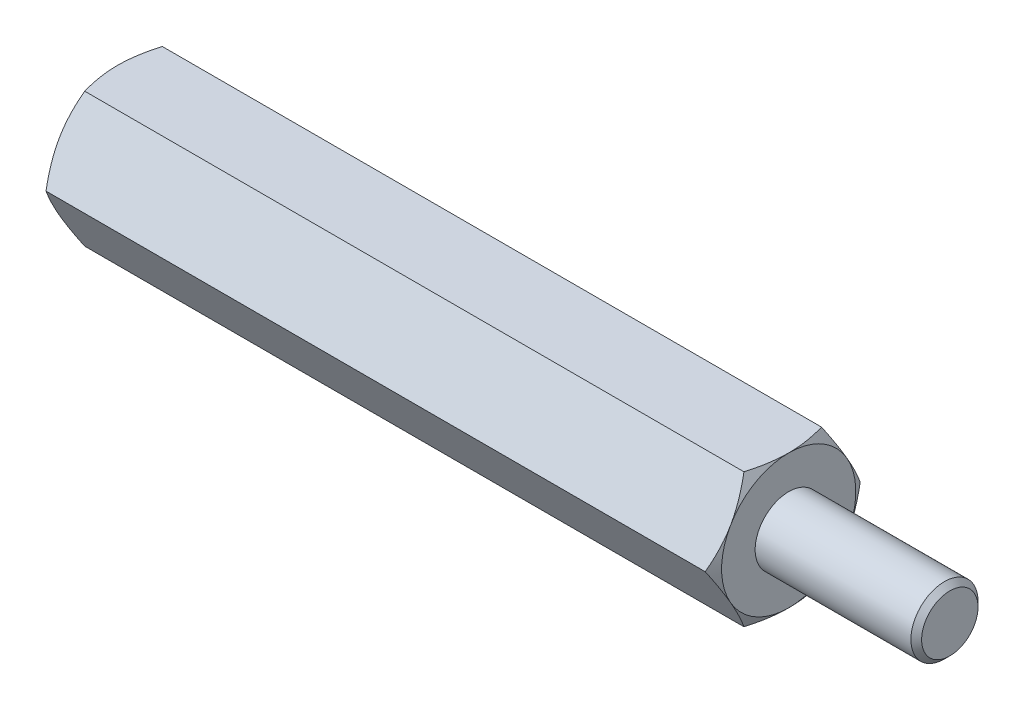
ISO-10303-21;
HEADER;
FILE_DESCRIPTION(('STEP AP214'),'2;1');
FILE_NAME('part.step','',(''),(''),'','','');
FILE_SCHEMA(('AUTOMOTIVE_DESIGN { 1 0 10303 214 1 1 1 1 }'));
ENDSEC;
DATA;
#1=APPLICATION_CONTEXT('core data for automotive mechanical design processes');
#2=APPLICATION_PROTOCOL_DEFINITION('international standard','automotive_design',2000,#1);
#3=PRODUCT_CONTEXT('',#1,'mechanical');
#4=PRODUCT('Part','Part','',(#3));
#5=PRODUCT_RELATED_PRODUCT_CATEGORY('part','',(#4));
#6=PRODUCT_DEFINITION_FORMATION('','',#4);
#7=PRODUCT_DEFINITION_CONTEXT('part definition',#1,'design');
#8=PRODUCT_DEFINITION('design','',#6,#7);
#9=PRODUCT_DEFINITION_SHAPE('','',#8);
#10=(LENGTH_UNIT() NAMED_UNIT(*) SI_UNIT(.MILLI.,.METRE.));
#11=(NAMED_UNIT(*) PLANE_ANGLE_UNIT() SI_UNIT($,.RADIAN.));
#12=(NAMED_UNIT(*) SI_UNIT($,.STERADIAN.) SOLID_ANGLE_UNIT());
#13=UNCERTAINTY_MEASURE_WITH_UNIT(LENGTH_MEASURE(1.E-05),#10,'distance_accuracy_value','');
#14=(GEOMETRIC_REPRESENTATION_CONTEXT(3) GLOBAL_UNCERTAINTY_ASSIGNED_CONTEXT((#13)) GLOBAL_UNIT_ASSIGNED_CONTEXT((#10,
#11,#12)) REPRESENTATION_CONTEXT('',''));
#15=CARTESIAN_POINT('',(0.,0.,0.));
#16=DIRECTION('',(0.,0.,1.));
#17=DIRECTION('',(1.,0.,0.));
#18=AXIS2_PLACEMENT_3D('',#15,#16,#17);
#19=CARTESIAN_POINT('',(12.5,2.5,-1.44337567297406));
#20=DIRECTION('',(1.,0.,0.));
#21=DIRECTION('',(0.,0.,-1.));
#22=AXIS2_PLACEMENT_3D('',#19,#20,#21);
#23=PLANE('',#22);
#24=CARTESIAN_POINT('',(12.5,0.,0.));
#25=DIRECTION('',(1.,0.,0.));
#26=DIRECTION('',(0.,0.,-1.));
#27=AXIS2_PLACEMENT_3D('',#24,#25,#26);
#28=CIRCLE('',#27,2.5);
#29=CARTESIAN_POINT('',(12.5,-1.25,-2.1650635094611));
#30=VERTEX_POINT('',#29);
#31=CARTESIAN_POINT('',(12.5,1.25,-2.1650635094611));
#32=VERTEX_POINT('',#31);
#33=EDGE_CURVE('E288',#30,#32,#28,.T.);
#34=ORIENTED_EDGE('',*,*,#33,.T.);
#35=CARTESIAN_POINT('',(12.5,2.5,0.));
#36=VERTEX_POINT('',#35);
#37=EDGE_CURVE('E53',#32,#36,#28,.T.);
#38=ORIENTED_EDGE('',*,*,#37,.T.);
#39=CARTESIAN_POINT('',(12.5,1.25,2.1650635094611));
#40=VERTEX_POINT('',#39);
#41=EDGE_CURVE('E296',#36,#40,#28,.T.);
#42=ORIENTED_EDGE('',*,*,#41,.T.);
#43=CARTESIAN_POINT('',(12.5,-1.25,2.1650635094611));
#44=VERTEX_POINT('',#43);
#45=EDGE_CURVE('E301',#40,#44,#28,.T.);
#46=ORIENTED_EDGE('',*,*,#45,.T.);
#47=CARTESIAN_POINT('',(12.5,0.,0.));
#48=DIRECTION('',(-1.,0.,0.));
#49=DIRECTION('',(0.,-1.,0.));
#50=AXIS2_PLACEMENT_3D('',#47,#48,#49);
#51=CIRCLE('',#50,2.5);
#52=CARTESIAN_POINT('',(12.5,-2.50000000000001,0.));
#53=VERTEX_POINT('',#52);
#54=EDGE_CURVE('E193',#53,#44,#51,.T.);
#55=ORIENTED_EDGE('',*,*,#54,.F.);
#56=EDGE_CURVE('E61',#53,#30,#28,.T.);
#57=ORIENTED_EDGE('',*,*,#56,.T.);
#58=EDGE_LOOP('',(#34,#38,#42,#46,#55,#57));
#59=FACE_BOUND('',#58,.T.);
#60=CARTESIAN_POINT('',(12.5,0.,0.));
#61=DIRECTION('',(1.,0.,0.));
#62=DIRECTION('',(0.,0.,-1.));
#63=AXIS2_PLACEMENT_3D('',#60,#61,#62);
#64=CIRCLE('',#63,1.25);
#65=CARTESIAN_POINT('',(12.5,0.,-1.25));
#66=VERTEX_POINT('',#65);
#67=EDGE_CURVE('E353',#66,#66,#64,.T.);
#68=ORIENTED_EDGE('',*,*,#67,.F.);
#69=EDGE_LOOP('',(#68));
#70=FACE_BOUND('',#69,.T.);
#71=ADVANCED_FACE('F37',(#59,#70),#23,.T.);
#72=CARTESIAN_POINT('',(12.5,0.,-2.88675134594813));
#73=DIRECTION('',(0.,-0.5,0.866025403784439));
#74=DIRECTION('',(0.,-0.866025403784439,-0.5));
#75=AXIS2_PLACEMENT_3D('',#72,#73,#74);
#76=PLANE('',#75);
#77=CARTESIAN_POINT('',(12.2766423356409,-0.000199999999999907,-2.88686681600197));
#78=CARTESIAN_POINT('',(12.3132783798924,0.109663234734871,-2.82343724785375));
#79=CARTESIAN_POINT('',(12.3465977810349,0.220474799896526,-2.75946016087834));
#80=CARTESIAN_POINT('',(12.4047577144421,0.444016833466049,-2.63039810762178));
#81=CARTESIAN_POINT('',(12.4295776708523,0.556751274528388,-2.5653108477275));
#82=CARTESIAN_POINT('',(12.468214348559,0.780822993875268,-2.43594298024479));
#83=CARTESIAN_POINT('',(12.4822882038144,0.892125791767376,-2.37168227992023));
#84=CARTESIAN_POINT('',(12.4990908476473,1.11525522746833,-2.24285844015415));
#85=CARTESIAN_POINT('',(12.5018335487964,1.22708105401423,-2.17829576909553));
#86=CARTESIAN_POINT('',(12.4961342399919,1.43604197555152,-2.05765212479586));
#87=CARTESIAN_POINT('',(12.4890916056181,1.53320831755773,-2.0015531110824));
#88=CARTESIAN_POINT('',(12.4667685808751,1.726907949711,-1.88972057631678));
#89=CARTESIAN_POINT('',(12.4514805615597,1.82344056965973,-1.8339874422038));
#90=CARTESIAN_POINT('',(12.4132609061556,2.01753972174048,-1.7219242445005));
#91=CARTESIAN_POINT('',(12.3901672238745,2.11508168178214,-1.66560836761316));
#92=CARTESIAN_POINT('',(12.3377533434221,2.30871060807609,-1.55381665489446));
#93=CARTESIAN_POINT('',(12.3084454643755,2.40480005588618,-1.49833938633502));
#94=CARTESIAN_POINT('',(12.2766423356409,2.5002,-1.44326020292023));
#95=B_SPLINE_CURVE_WITH_KNOTS('',3,(#77,#78,#79,#80,#81,#82,#83,#84,#85,#86,#87,#88,#89,#90,#91,
#92,#93,#94),.UNSPECIFIED.,.F.,.F.,(4,2,2,2,2,2,2,2,4),(0.,0.396285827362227,0.79352433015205,
1.18093086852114,1.56786160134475,1.90479741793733,2.24204551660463,2.58677531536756,
2.93082800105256),.UNSPECIFIED.);
#96=CARTESIAN_POINT('',(12.2767090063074,0.,-2.88675134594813));
#97=VERTEX_POINT('',#96);
#98=EDGE_CURVE('E350',#97,#32,#95,.T.);
#99=ORIENTED_EDGE('',*,*,#98,.F.);
#100=DIRECTION('',(-1.,0.,0.));
#101=VECTOR('',#100,1.);
#102=CARTESIAN_POINT('',(12.5,0.,-2.88675134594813));
#103=LINE('',#102,#101);
#104=CARTESIAN_POINT('',(-12.2767090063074,0.,-2.88675134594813));
#105=VERTEX_POINT('',#104);
#106=EDGE_CURVE('E264',#97,#105,#103,.T.);
#107=ORIENTED_EDGE('',*,*,#106,.T.);
#108=CARTESIAN_POINT('',(-12.2766423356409,2.5002,-1.44326020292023));
#109=CARTESIAN_POINT('',(-12.3132783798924,2.39033676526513,-1.50668977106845));
#110=CARTESIAN_POINT('',(-12.3465977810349,2.27952520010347,-1.57066685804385));
#111=CARTESIAN_POINT('',(-12.4047577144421,2.05598316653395,-1.69972891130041));
#112=CARTESIAN_POINT('',(-12.4295776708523,1.94324872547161,-1.7648161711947));
#113=CARTESIAN_POINT('',(-12.468214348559,1.71917700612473,-1.8941840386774));
#114=CARTESIAN_POINT('',(-12.4822882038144,1.60787420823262,-1.95844473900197));
#115=CARTESIAN_POINT('',(-12.4990908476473,1.38474477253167,-2.08726857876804));
#116=CARTESIAN_POINT('',(-12.5018335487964,1.27291894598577,-2.15183124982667));
#117=CARTESIAN_POINT('',(-12.4961342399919,1.06395802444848,-2.27247489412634));
#118=CARTESIAN_POINT('',(-12.4890916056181,0.96679168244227,-2.32857390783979));
#119=CARTESIAN_POINT('',(-12.4667685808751,0.773092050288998,-2.44040644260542));
#120=CARTESIAN_POINT('',(-12.4514805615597,0.676559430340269,-2.49613957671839));
#121=CARTESIAN_POINT('',(-12.4132609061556,0.482460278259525,-2.60820277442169));
#122=CARTESIAN_POINT('',(-12.3901672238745,0.38491831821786,-2.66451865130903));
#123=CARTESIAN_POINT('',(-12.3377533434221,0.191289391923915,-2.77631036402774));
#124=CARTESIAN_POINT('',(-12.3084454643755,0.0951999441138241,-2.83178763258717));
#125=CARTESIAN_POINT('',(-12.2766423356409,-0.000199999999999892,-2.88686681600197));
#126=B_SPLINE_CURVE_WITH_KNOTS('',3,(#108,#109,#110,#111,#112,#113,#114,#115,#116,#117,#118,
#119,#120,#121,#122,#123,#124,#125),.UNSPECIFIED.,.F.,.F.,(4,2,2,2,2,2,2,2,4),(0.,
0.396285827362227,0.79352433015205,1.18093086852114,1.56786160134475,1.90479741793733,
2.24204551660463,2.58677531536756,2.93082800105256),.UNSPECIFIED.);
#127=CARTESIAN_POINT('',(-12.5,1.25,-2.1650635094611));
#128=VERTEX_POINT('',#127);
#129=EDGE_CURVE('E403',#128,#105,#126,.T.);
#130=ORIENTED_EDGE('',*,*,#129,.F.);
#131=CARTESIAN_POINT('',(-12.2767090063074,2.5,-1.44337567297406));
#132=VERTEX_POINT('',#131);
#133=EDGE_CURVE('E325',#132,#128,#126,.T.);
#134=ORIENTED_EDGE('',*,*,#133,.F.);
#135=DIRECTION('',(-1.,0.,0.));
#136=VECTOR('',#135,1.);
#137=CARTESIAN_POINT('',(12.5,2.5,-1.44337567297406));
#138=LINE('',#137,#136);
#139=CARTESIAN_POINT('',(12.2767090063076,2.5,-1.44337567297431));
#140=VERTEX_POINT('',#139);
#141=EDGE_CURVE('E279',#140,#132,#138,.T.);
#142=ORIENTED_EDGE('',*,*,#141,.F.);
#143=EDGE_CURVE('E229',#32,#140,#95,.T.);
#144=ORIENTED_EDGE('',*,*,#143,.F.);
#145=EDGE_LOOP('',(#99,#107,#130,#134,#142,#144));
#146=FACE_BOUND('',#145,.T.);
#147=ADVANCED_FACE('F148',(#146),#76,.F.);
#148=CARTESIAN_POINT('',(12.5,2.5,-1.44337567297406));
#149=DIRECTION('',(0.,-1.,0.));
#150=DIRECTION('',(0.,0.,-1.));
#151=AXIS2_PLACEMENT_3D('',#148,#149,#150);
#152=PLANE('',#151);
#153=CARTESIAN_POINT('',(11.2680338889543,2.5,-3.90158441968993));
#154=CARTESIAN_POINT('',(11.3212077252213,2.5,-3.79217004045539));
#155=CARTESIAN_POINT('',(11.3738786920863,2.5,-3.68250707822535));
#156=CARTESIAN_POINT('',(11.4779324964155,2.5,-3.46255185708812));
#157=CARTESIAN_POINT('',(11.5293151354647,2.5,-3.35225950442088));
#158=CARTESIAN_POINT('',(11.6307630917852,2.5,-3.13035696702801));
#159=CARTESIAN_POINT('',(11.6808199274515,2.5,-3.0187428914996));
#160=CARTESIAN_POINT('',(11.7789171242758,2.5,-2.79463535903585));
#161=CARTESIAN_POINT('',(11.8269575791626,2.5,-2.68214194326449));
#162=CARTESIAN_POINT('',(11.9220184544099,2.5,-2.45240385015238));
#163=CARTESIAN_POINT('',(11.9689543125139,2.5,-2.33512399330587));
#164=CARTESIAN_POINT('',(12.0593326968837,2.5,-2.09920133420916));
#165=CARTESIAN_POINT('',(12.1027748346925,2.5,-1.98055838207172));
#166=CARTESIAN_POINT('',(12.1850435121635,2.5,-1.74193489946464));
#167=CARTESIAN_POINT('',(12.2238791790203,2.5,-1.6219575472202));
#168=CARTESIAN_POINT('',(12.2957050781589,2.5,-1.38028205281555));
#169=CARTESIAN_POINT('',(12.3286971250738,2.5,-1.25858445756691));
#170=CARTESIAN_POINT('',(12.3870959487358,2.5,-1.01406369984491));
#171=CARTESIAN_POINT('',(12.4125437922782,2.5,-0.89125052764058));
#172=CARTESIAN_POINT('',(12.4544275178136,2.5,-0.64407172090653));
#173=CARTESIAN_POINT('',(12.4708643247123,2.5,-0.519706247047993));
#174=CARTESIAN_POINT('',(12.4932006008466,2.5,-0.271679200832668));
#175=CARTESIAN_POINT('',(12.4992375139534,2.5,-0.148030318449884));
#176=CARTESIAN_POINT('',(12.5006256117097,2.5,0.0993395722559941));
#177=CARTESIAN_POINT('',(12.4959765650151,2.5,0.223060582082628));
#178=CARTESIAN_POINT('',(12.4794044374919,2.5,0.432351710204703));
#179=CARTESIAN_POINT('',(12.4701066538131,2.5,0.518143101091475));
#180=CARTESIAN_POINT('',(12.4469384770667,2.5,0.689112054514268));
#181=CARTESIAN_POINT('',(12.4330674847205,2.5,0.774289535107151));
#182=CARTESIAN_POINT('',(12.3853202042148,2.5,1.02876599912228));
#183=CARTESIAN_POINT('',(12.3453176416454,2.5,1.19691958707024));
#184=CARTESIAN_POINT('',(12.2522656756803,2.5,1.53362893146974));
#185=CARTESIAN_POINT('',(12.1989362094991,2.5,1.70210423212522));
#186=CARTESIAN_POINT('',(12.1123716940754,2.5,1.95247339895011));
#187=CARTESIAN_POINT('',(12.0824247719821,2.5,2.03553184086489));
#188=CARTESIAN_POINT('',(12.0206840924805,2.5,2.20095860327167));
#189=CARTESIAN_POINT('',(11.9888903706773,2.5,2.2833269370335));
#190=CARTESIAN_POINT('',(11.904014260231,2.5,2.49723312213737));
#191=CARTESIAN_POINT('',(11.8497173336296,2.5,2.6282879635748));
#192=CARTESIAN_POINT('',(11.7381273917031,2.5,2.88912034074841));
#193=CARTESIAN_POINT('',(11.6808341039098,2.5,3.01889775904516));
#194=CARTESIAN_POINT('',(11.5639348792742,2.5,3.27745045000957));
#195=CARTESIAN_POINT('',(11.504328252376,2.5,3.40622540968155));
#196=CARTESIAN_POINT('',(11.3833234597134,2.5,3.66293235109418));
#197=CARTESIAN_POINT('',(11.321925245,2.5,3.79086430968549));
#198=CARTESIAN_POINT('',(11.1354580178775,2.5,4.17399495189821));
#199=CARTESIAN_POINT('',(11.0082824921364,2.5,4.42816724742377));
#200=CARTESIAN_POINT('',(10.7503455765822,2.5,4.93461464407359));
#201=CARTESIAN_POINT('',(10.6195848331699,2.5,5.18689007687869));
#202=CARTESIAN_POINT('',(10.3687100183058,2.5,5.66512451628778));
#203=CARTESIAN_POINT('',(10.2488298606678,2.5,5.89120644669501));
#204=CARTESIAN_POINT('',(10.0075902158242,2.5,6.34259369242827));
#205=CARTESIAN_POINT('',(9.88623065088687,2.5,6.56789896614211));
#206=CARTESIAN_POINT('',(9.64278038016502,2.5,7.01722044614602));
#207=CARTESIAN_POINT('',(9.52069305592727,2.5,7.24123848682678));
#208=CARTESIAN_POINT('',(9.27566624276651,2.5,7.68878772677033));
#209=CARTESIAN_POINT('',(9.15272681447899,2.5,7.9123189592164));
#210=CARTESIAN_POINT('',(9.02947566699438,2.5,8.13567697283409));
#211=B_SPLINE_CURVE_WITH_KNOTS('',3,(#153,#154,#155,#156,#157,#158,#159,#160,#161,#162,#163,
#164,#165,#166,#167,#168,#169,#170,#171,#172,#173,#174,#175,#176,#177,#178,#179,#180,#181,#182,
#183,#184,#185,#186,#187,#188,#189,#190,#191,#192,#193,#194,#195,#196,#197,#198,#199,#200,#201,
#202,#203,#204,#205,#206,#207,#208,#209,#210),.UNSPECIFIED.,.F.,.F.,(4,2,2,2,2,2,2,2,2,2,2,2,2,
2,2,2,2,2,2,2,2,2,2,2,2,2,2,2,4),(0.,0.364957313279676,0.729970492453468,1.09692930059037,
1.46387103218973,1.84279746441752,2.22176597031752,2.59997058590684,2.97805755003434,
3.35404692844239,3.72999770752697,4.10094071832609,4.47189175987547,4.73064905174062,
4.98944026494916,5.5072907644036,6.03710483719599,6.30196454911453,6.56681915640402,
6.99233818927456,7.41789598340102,7.84358170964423,8.26927907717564,9.12186602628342,
9.9743002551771,10.7419897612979,11.5097197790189,12.2750964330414,13.0404191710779),.UNSPECIFIED.);
#212=EDGE_CURVE('E227',#140,#36,#211,.T.);
#213=ORIENTED_EDGE('',*,*,#212,.F.);
#214=ORIENTED_EDGE('',*,*,#141,.T.);
#215=CARTESIAN_POINT('',(-11.2680338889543,2.5,-3.90158441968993));
#216=CARTESIAN_POINT('',(-11.3212077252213,2.5,-3.79217004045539));
#217=CARTESIAN_POINT('',(-11.3738786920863,2.5,-3.68250707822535));
#218=CARTESIAN_POINT('',(-11.4779324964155,2.5,-3.46255185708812));
#219=CARTESIAN_POINT('',(-11.5293151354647,2.5,-3.35225950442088));
#220=CARTESIAN_POINT('',(-11.6307630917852,2.5,-3.13035696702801));
#221=CARTESIAN_POINT('',(-11.6808199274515,2.5,-3.0187428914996));
#222=CARTESIAN_POINT('',(-11.7789171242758,2.5,-2.79463535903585));
#223=CARTESIAN_POINT('',(-11.8269575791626,2.5,-2.68214194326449));
#224=CARTESIAN_POINT('',(-11.9220184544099,2.5,-2.45240385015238));
#225=CARTESIAN_POINT('',(-11.9689543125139,2.5,-2.33512399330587));
#226=CARTESIAN_POINT('',(-12.0593326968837,2.5,-2.09920133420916));
#227=CARTESIAN_POINT('',(-12.1027748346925,2.5,-1.98055838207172));
#228=CARTESIAN_POINT('',(-12.1850435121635,2.5,-1.74193489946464));
#229=CARTESIAN_POINT('',(-12.2238791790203,2.5,-1.6219575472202));
#230=CARTESIAN_POINT('',(-12.2957050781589,2.5,-1.38028205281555));
#231=CARTESIAN_POINT('',(-12.3286971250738,2.5,-1.25858445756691));
#232=CARTESIAN_POINT('',(-12.3870959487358,2.5,-1.01406369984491));
#233=CARTESIAN_POINT('',(-12.4125437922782,2.5,-0.89125052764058));
#234=CARTESIAN_POINT('',(-12.4544275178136,2.5,-0.64407172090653));
#235=CARTESIAN_POINT('',(-12.4708643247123,2.5,-0.519706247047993));
#236=CARTESIAN_POINT('',(-12.4932006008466,2.5,-0.271679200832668));
#237=CARTESIAN_POINT('',(-12.4992375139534,2.5,-0.148030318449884));
#238=CARTESIAN_POINT('',(-12.5006256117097,2.5,0.0993395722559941));
#239=CARTESIAN_POINT('',(-12.4959765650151,2.5,0.223060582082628));
#240=CARTESIAN_POINT('',(-12.4794044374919,2.5,0.432351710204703));
#241=CARTESIAN_POINT('',(-12.4701066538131,2.5,0.518143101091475));
#242=CARTESIAN_POINT('',(-12.4469384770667,2.5,0.689112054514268));
#243=CARTESIAN_POINT('',(-12.4330674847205,2.5,0.774289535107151));
#244=CARTESIAN_POINT('',(-12.3853202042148,2.5,1.02876599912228));
#245=CARTESIAN_POINT('',(-12.3453176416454,2.5,1.19691958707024));
#246=CARTESIAN_POINT('',(-12.2522656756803,2.5,1.53362893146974));
#247=CARTESIAN_POINT('',(-12.1989362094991,2.5,1.70210423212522));
#248=CARTESIAN_POINT('',(-12.1123716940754,2.5,1.95247339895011));
#249=CARTESIAN_POINT('',(-12.0824247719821,2.5,2.03553184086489));
#250=CARTESIAN_POINT('',(-12.0206840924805,2.5,2.20095860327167));
#251=CARTESIAN_POINT('',(-11.9888903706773,2.5,2.2833269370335));
#252=CARTESIAN_POINT('',(-11.904014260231,2.5,2.49723312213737));
#253=CARTESIAN_POINT('',(-11.8497173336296,2.5,2.6282879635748));
#254=CARTESIAN_POINT('',(-11.7381273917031,2.5,2.88912034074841));
#255=CARTESIAN_POINT('',(-11.6808341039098,2.5,3.01889775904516));
#256=CARTESIAN_POINT('',(-11.5639348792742,2.5,3.27745045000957));
#257=CARTESIAN_POINT('',(-11.504328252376,2.5,3.40622540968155));
#258=CARTESIAN_POINT('',(-11.3833234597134,2.5,3.66293235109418));
#259=CARTESIAN_POINT('',(-11.321925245,2.5,3.79086430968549));
#260=CARTESIAN_POINT('',(-11.1354580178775,2.5,4.17399495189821));
#261=CARTESIAN_POINT('',(-11.0082824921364,2.5,4.42816724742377));
#262=CARTESIAN_POINT('',(-10.7503455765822,2.5,4.93461464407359));
#263=CARTESIAN_POINT('',(-10.6195848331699,2.5,5.18689007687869));
#264=CARTESIAN_POINT('',(-10.3687100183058,2.5,5.66512451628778));
#265=CARTESIAN_POINT('',(-10.2488298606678,2.5,5.89120644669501));
#266=CARTESIAN_POINT('',(-10.0075902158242,2.5,6.34259369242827));
#267=CARTESIAN_POINT('',(-9.88623065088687,2.5,6.56789896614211));
#268=CARTESIAN_POINT('',(-9.64278038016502,2.5,7.01722044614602));
#269=CARTESIAN_POINT('',(-9.52069305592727,2.5,7.24123848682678));
#270=CARTESIAN_POINT('',(-9.27566624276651,2.5,7.68878772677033));
#271=CARTESIAN_POINT('',(-9.15272681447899,2.5,7.9123189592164));
#272=CARTESIAN_POINT('',(-9.02947566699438,2.5,8.13567697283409));
#273=B_SPLINE_CURVE_WITH_KNOTS('',3,(#215,#216,#217,#218,#219,#220,#221,#222,#223,#224,#225,
#226,#227,#228,#229,#230,#231,#232,#233,#234,#235,#236,#237,#238,#239,#240,#241,#242,#243,#244,
#245,#246,#247,#248,#249,#250,#251,#252,#253,#254,#255,#256,#257,#258,#259,#260,#261,#262,#263,
#264,#265,#266,#267,#268,#269,#270,#271,#272),.UNSPECIFIED.,.F.,.F.,(4,2,2,2,2,2,2,2,2,2,2,2,2,
2,2,2,2,2,2,2,2,2,2,2,2,2,2,2,4),(0.,0.364957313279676,0.729970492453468,1.09692930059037,
1.46387103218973,1.84279746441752,2.22176597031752,2.59997058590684,2.97805755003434,
3.35404692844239,3.72999770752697,4.10094071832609,4.47189175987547,4.73064905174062,
4.98944026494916,5.5072907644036,6.03710483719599,6.30196454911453,6.56681915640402,
6.99233818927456,7.41789598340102,7.84358170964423,8.26927907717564,9.12186602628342,
9.9743002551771,10.7419897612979,11.5097197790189,12.2750964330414,13.0404191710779),.UNSPECIFIED.);
#274=CARTESIAN_POINT('',(-12.5,2.5,0.));
#275=VERTEX_POINT('',#274);
#276=EDGE_CURVE('E241',#275,#132,#273,.F.);
#277=ORIENTED_EDGE('',*,*,#276,.F.);
#278=CARTESIAN_POINT('',(-12.2767090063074,2.5,1.44337567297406));
#279=VERTEX_POINT('',#278);
#280=EDGE_CURVE('E249',#279,#275,#273,.F.);
#281=ORIENTED_EDGE('',*,*,#280,.F.);
#282=DIRECTION('',(-1.,0.,0.));
#283=VECTOR('',#282,1.);
#284=CARTESIAN_POINT('',(12.5,2.5,1.44337567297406));
#285=LINE('',#284,#283);
#286=CARTESIAN_POINT('',(12.2767090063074,2.5,1.44337567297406));
#287=VERTEX_POINT('',#286);
#288=EDGE_CURVE('E276',#287,#279,#285,.T.);
#289=ORIENTED_EDGE('',*,*,#288,.F.);
#290=EDGE_CURVE('E221',#36,#287,#211,.T.);
#291=ORIENTED_EDGE('',*,*,#290,.F.);
#292=EDGE_LOOP('',(#213,#214,#277,#281,#289,#291));
#293=FACE_BOUND('',#292,.T.);
#294=ADVANCED_FACE('F153',(#293),#152,.F.);
#295=CARTESIAN_POINT('',(12.5,2.5,1.44337567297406));
#296=DIRECTION('',(0.,-0.5,-0.866025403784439));
#297=DIRECTION('',(0.,0.866025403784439,-0.5));
#298=AXIS2_PLACEMENT_3D('',#295,#296,#297);
#299=PLANE('',#298);
#300=CARTESIAN_POINT('',(12.2766423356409,2.5002,1.44326020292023));
#301=CARTESIAN_POINT('',(12.3132783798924,2.39033676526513,1.50668977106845));
#302=CARTESIAN_POINT('',(12.3465977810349,2.27952520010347,1.57066685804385));
#303=CARTESIAN_POINT('',(12.4047577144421,2.05598316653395,1.69972891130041));
#304=CARTESIAN_POINT('',(12.4295776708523,1.94324872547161,1.7648161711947));
#305=CARTESIAN_POINT('',(12.468214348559,1.71917700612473,1.8941840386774));
#306=CARTESIAN_POINT('',(12.4822882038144,1.60787420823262,1.95844473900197));
#307=CARTESIAN_POINT('',(12.4990908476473,1.38474477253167,2.08726857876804));
#308=CARTESIAN_POINT('',(12.5018335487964,1.27291894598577,2.15183124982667));
#309=CARTESIAN_POINT('',(12.4961342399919,1.06395802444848,2.27247489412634));
#310=CARTESIAN_POINT('',(12.4890916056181,0.96679168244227,2.32857390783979));
#311=CARTESIAN_POINT('',(12.4667685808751,0.773092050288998,2.44040644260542));
#312=CARTESIAN_POINT('',(12.4514805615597,0.676559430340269,2.49613957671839));
#313=CARTESIAN_POINT('',(12.4132609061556,0.482460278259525,2.60820277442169));
#314=CARTESIAN_POINT('',(12.3901672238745,0.38491831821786,2.66451865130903));
#315=CARTESIAN_POINT('',(12.3377533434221,0.191289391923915,2.77631036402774));
#316=CARTESIAN_POINT('',(12.3084454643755,0.0951999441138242,2.83178763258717));
#317=CARTESIAN_POINT('',(12.2766423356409,-0.000199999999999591,2.88686681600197));
#318=B_SPLINE_CURVE_WITH_KNOTS('',3,(#300,#301,#302,#303,#304,#305,#306,#307,#308,#309,#310,
#311,#312,#313,#314,#315,#316,#317),.UNSPECIFIED.,.F.,.F.,(4,2,2,2,2,2,2,2,4),(0.,
0.396285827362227,0.79352433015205,1.18093086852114,1.56786160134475,1.90479741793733,
2.24204551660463,2.58677531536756,2.93082800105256),.UNSPECIFIED.);
#319=EDGE_CURVE('E228',#287,#40,#318,.T.);
#320=ORIENTED_EDGE('',*,*,#319,.F.);
#321=ORIENTED_EDGE('',*,*,#288,.T.);
#322=CARTESIAN_POINT('',(-12.2766423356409,-0.000199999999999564,2.88686681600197));
#323=CARTESIAN_POINT('',(-12.3132783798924,0.109663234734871,2.82343724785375));
#324=CARTESIAN_POINT('',(-12.3465977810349,0.220474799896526,2.75946016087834));
#325=CARTESIAN_POINT('',(-12.4047577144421,0.44401683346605,2.63039810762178));
#326=CARTESIAN_POINT('',(-12.4295776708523,0.556751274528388,2.5653108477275));
#327=CARTESIAN_POINT('',(-12.468214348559,0.780822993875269,2.43594298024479));
#328=CARTESIAN_POINT('',(-12.4822882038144,0.892125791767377,2.37168227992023));
#329=CARTESIAN_POINT('',(-12.4990908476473,1.11525522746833,2.24285844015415));
#330=CARTESIAN_POINT('',(-12.5018335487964,1.22708105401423,2.17829576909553));
#331=CARTESIAN_POINT('',(-12.4961342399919,1.43604197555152,2.05765212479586));
#332=CARTESIAN_POINT('',(-12.4890916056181,1.53320831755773,2.0015531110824));
#333=CARTESIAN_POINT('',(-12.4667685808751,1.726907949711,1.88972057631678));
#334=CARTESIAN_POINT('',(-12.4514805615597,1.82344056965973,1.8339874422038));
#335=CARTESIAN_POINT('',(-12.4132609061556,2.01753972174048,1.7219242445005));
#336=CARTESIAN_POINT('',(-12.3901672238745,2.11508168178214,1.66560836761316));
#337=CARTESIAN_POINT('',(-12.3377533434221,2.30871060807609,1.55381665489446));
#338=CARTESIAN_POINT('',(-12.3084454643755,2.40480005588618,1.49833938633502));
#339=CARTESIAN_POINT('',(-12.2766423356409,2.5002,1.44326020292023));
#340=B_SPLINE_CURVE_WITH_KNOTS('',3,(#322,#323,#324,#325,#326,#327,#328,#329,#330,#331,#332,
#333,#334,#335,#336,#337,#338,#339),.UNSPECIFIED.,.F.,.F.,(4,2,2,2,2,2,2,2,4),(0.,
0.396285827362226,0.79352433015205,1.18093086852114,1.56786160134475,1.90479741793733,
2.24204551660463,2.58677531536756,2.93082800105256),.UNSPECIFIED.);
#341=CARTESIAN_POINT('',(-12.5,1.25,2.1650635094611));
#342=VERTEX_POINT('',#341);
#343=EDGE_CURVE('E255',#342,#279,#340,.T.);
#344=ORIENTED_EDGE('',*,*,#343,.F.);
#345=CARTESIAN_POINT('',(-12.2767090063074,0.,2.88675134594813));
#346=VERTEX_POINT('',#345);
#347=EDGE_CURVE('E262',#346,#342,#340,.T.);
#348=ORIENTED_EDGE('',*,*,#347,.F.);
#349=DIRECTION('',(-1.,0.,0.));
#350=VECTOR('',#349,1.);
#351=CARTESIAN_POINT('',(12.5,0.,2.88675134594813));
#352=LINE('',#351,#350);
#353=CARTESIAN_POINT('',(12.2767090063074,0.,2.88675134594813));
#354=VERTEX_POINT('',#353);
#355=EDGE_CURVE('E273',#354,#346,#352,.T.);
#356=ORIENTED_EDGE('',*,*,#355,.F.);
#357=EDGE_CURVE('E215',#40,#354,#318,.T.);
#358=ORIENTED_EDGE('',*,*,#357,.F.);
#359=EDGE_LOOP('',(#320,#321,#344,#348,#356,#358));
#360=FACE_BOUND('',#359,.T.);
#361=ADVANCED_FACE('F235',(#360),#299,.F.);
#362=CARTESIAN_POINT('',(12.5,0.,2.88675134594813));
#363=DIRECTION('',(0.,0.5,-0.866025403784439));
#364=DIRECTION('',(0.,0.866025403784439,0.5));
#365=AXIS2_PLACEMENT_3D('',#362,#363,#364);
#366=PLANE('',#365);
#367=CARTESIAN_POINT('',(12.2766423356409,0.000200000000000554,2.88686681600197));
#368=CARTESIAN_POINT('',(12.3132783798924,-0.10966323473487,2.82343724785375));
#369=CARTESIAN_POINT('',(12.3465977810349,-0.220474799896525,2.75946016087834));
#370=CARTESIAN_POINT('',(12.4047577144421,-0.444016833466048,2.63039810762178));
#371=CARTESIAN_POINT('',(12.4295776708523,-0.556751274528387,2.5653108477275));
#372=CARTESIAN_POINT('',(12.468214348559,-0.780822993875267,2.43594298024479));
#373=CARTESIAN_POINT('',(12.4822882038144,-0.892125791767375,2.37168227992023));
#374=CARTESIAN_POINT('',(12.4990908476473,-1.11525522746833,2.24285844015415));
#375=CARTESIAN_POINT('',(12.5018335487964,-1.22708105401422,2.17829576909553));
#376=CARTESIAN_POINT('',(12.496134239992,-1.43604197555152,2.05765212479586));
#377=CARTESIAN_POINT('',(12.4890916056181,-1.53320831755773,2.0015531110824));
#378=CARTESIAN_POINT('',(12.4667685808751,-1.726907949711,1.88972057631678));
#379=CARTESIAN_POINT('',(12.4514805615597,-1.82344056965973,1.8339874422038));
#380=CARTESIAN_POINT('',(12.4132609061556,-2.01753972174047,1.7219242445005));
#381=CARTESIAN_POINT('',(12.3901672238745,-2.11508168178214,1.66560836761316));
#382=CARTESIAN_POINT('',(12.3377533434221,-2.30871060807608,1.55381665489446));
#383=CARTESIAN_POINT('',(12.3084454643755,-2.40480005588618,1.49833938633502));
#384=CARTESIAN_POINT('',(12.2766423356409,-2.5002,1.44326020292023));
#385=B_SPLINE_CURVE_WITH_KNOTS('',3,(#367,#368,#369,#370,#371,#372,#373,#374,#375,#376,#377,
#378,#379,#380,#381,#382,#383,#384),.UNSPECIFIED.,.F.,.F.,(4,2,2,2,2,2,2,2,4),(0.,
0.396285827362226,0.793524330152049,1.18093086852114,1.56786160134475,1.90479741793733,
2.24204551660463,2.58677531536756,2.93082800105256),.UNSPECIFIED.);
#386=EDGE_CURVE('E320',#354,#44,#385,.T.);
#387=ORIENTED_EDGE('',*,*,#386,.F.);
#388=ORIENTED_EDGE('',*,*,#355,.T.);
#389=CARTESIAN_POINT('',(-12.2766423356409,-2.5002,1.44326020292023));
#390=CARTESIAN_POINT('',(-12.3132783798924,-2.39033676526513,1.50668977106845));
#391=CARTESIAN_POINT('',(-12.3465977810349,-2.27952520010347,1.57066685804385));
#392=CARTESIAN_POINT('',(-12.4047577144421,-2.05598316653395,1.69972891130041));
#393=CARTESIAN_POINT('',(-12.4295776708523,-1.94324872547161,1.7648161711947));
#394=CARTESIAN_POINT('',(-12.468214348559,-1.71917700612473,1.8941840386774));
#395=CARTESIAN_POINT('',(-12.4822882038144,-1.60787420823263,1.95844473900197));
#396=CARTESIAN_POINT('',(-12.4990908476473,-1.38474477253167,2.08726857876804));
#397=CARTESIAN_POINT('',(-12.5018335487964,-1.27291894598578,2.15183124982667));
#398=CARTESIAN_POINT('',(-12.496134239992,-1.06395802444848,2.27247489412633));
#399=CARTESIAN_POINT('',(-12.4890916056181,-0.966791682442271,2.32857390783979));
#400=CARTESIAN_POINT('',(-12.4667685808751,-0.773092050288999,2.44040644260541));
#401=CARTESIAN_POINT('',(-12.4514805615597,-0.676559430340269,2.49613957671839));
#402=CARTESIAN_POINT('',(-12.4132609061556,-0.482460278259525,2.60820277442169));
#403=CARTESIAN_POINT('',(-12.3901672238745,-0.38491831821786,2.66451865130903));
#404=CARTESIAN_POINT('',(-12.3377533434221,-0.191289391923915,2.77631036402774));
#405=CARTESIAN_POINT('',(-12.3084454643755,-0.0951999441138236,2.83178763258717));
#406=CARTESIAN_POINT('',(-12.2766423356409,0.000200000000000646,2.88686681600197));
#407=B_SPLINE_CURVE_WITH_KNOTS('',3,(#389,#390,#391,#392,#393,#394,#395,#396,#397,#398,#399,
#400,#401,#402,#403,#404,#405,#406),.UNSPECIFIED.,.F.,.F.,(4,2,2,2,2,2,2,2,4),(0.,
0.396285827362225,0.793524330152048,1.18093086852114,1.56786160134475,1.90479741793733,
2.24204551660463,2.58677531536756,2.93082800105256),.UNSPECIFIED.);
#408=CARTESIAN_POINT('',(-12.5,-1.25,2.1650635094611));
#409=VERTEX_POINT('',#408);
#410=EDGE_CURVE('E263',#409,#346,#407,.T.);
#411=ORIENTED_EDGE('',*,*,#410,.F.);
#412=CARTESIAN_POINT('',(-12.2767090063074,-2.5,1.44337567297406));
#413=VERTEX_POINT('',#412);
#414=EDGE_CURVE('E250',#413,#409,#407,.T.);
#415=ORIENTED_EDGE('',*,*,#414,.F.);
#416=DIRECTION('',(-1.,0.,0.));
#417=VECTOR('',#416,1.);
#418=CARTESIAN_POINT('',(12.5,-2.5,1.44337567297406));
#419=LINE('',#418,#417);
#420=CARTESIAN_POINT('',(12.2767090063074,-2.5,1.44337567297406));
#421=VERTEX_POINT('',#420);
#422=EDGE_CURVE('E270',#421,#413,#419,.T.);
#423=ORIENTED_EDGE('',*,*,#422,.F.);
#424=EDGE_CURVE('E210',#44,#421,#385,.T.);
#425=ORIENTED_EDGE('',*,*,#424,.F.);
#426=EDGE_LOOP('',(#387,#388,#411,#415,#423,#425));
#427=FACE_BOUND('',#426,.T.);
#428=ADVANCED_FACE('F337',(#427),#366,.F.);
#429=CARTESIAN_POINT('',(12.5,-2.5,1.44337567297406));
#430=DIRECTION('',(0.,1.,0.));
#431=DIRECTION('',(0.,0.,1.));
#432=AXIS2_PLACEMENT_3D('',#429,#430,#431);
#433=PLANE('',#432);
#434=CARTESIAN_POINT('',(11.2680338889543,-2.5,-3.90158441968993));
#435=CARTESIAN_POINT('',(11.3212077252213,-2.5,-3.79217004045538));
#436=CARTESIAN_POINT('',(11.3738786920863,-2.5,-3.68250707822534));
#437=CARTESIAN_POINT('',(11.4779324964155,-2.5,-3.46255185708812));
#438=CARTESIAN_POINT('',(11.5293151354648,-2.5,-3.35225950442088));
#439=CARTESIAN_POINT('',(11.6307630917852,-2.5,-3.130356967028));
#440=CARTESIAN_POINT('',(11.6808199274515,-2.5,-3.01874289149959));
#441=CARTESIAN_POINT('',(11.7789171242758,-2.5,-2.79463535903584));
#442=CARTESIAN_POINT('',(11.8269575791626,-2.5,-2.68214194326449));
#443=CARTESIAN_POINT('',(11.9220184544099,-2.5,-2.45240385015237));
#444=CARTESIAN_POINT('',(11.9689543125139,-2.5,-2.33512399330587));
#445=CARTESIAN_POINT('',(12.0593326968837,-2.5,-2.09920133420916));
#446=CARTESIAN_POINT('',(12.1027748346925,-2.5,-1.98055838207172));
#447=CARTESIAN_POINT('',(12.1850435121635,-2.5,-1.74193489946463));
#448=CARTESIAN_POINT('',(12.2238791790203,-2.5,-1.6219575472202));
#449=CARTESIAN_POINT('',(12.2957050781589,-2.5,-1.38028205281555));
#450=CARTESIAN_POINT('',(12.3286971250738,-2.5,-1.25858445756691));
#451=CARTESIAN_POINT('',(12.3870959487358,-2.5,-1.01406369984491));
#452=CARTESIAN_POINT('',(12.4125437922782,-2.5,-0.891250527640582));
#453=CARTESIAN_POINT('',(12.4544275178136,-2.5,-0.644071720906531));
#454=CARTESIAN_POINT('',(12.4708643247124,-2.5,-0.519706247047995));
#455=CARTESIAN_POINT('',(12.4932006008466,-2.5,-0.271679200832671));
#456=CARTESIAN_POINT('',(12.4992375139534,-2.5,-0.148030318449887));
#457=CARTESIAN_POINT('',(12.5006256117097,-2.5,0.0993395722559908));
#458=CARTESIAN_POINT('',(12.4959765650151,-2.5,0.223060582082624));
#459=CARTESIAN_POINT('',(12.4794044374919,-2.5,0.432351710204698));
#460=CARTESIAN_POINT('',(12.4701066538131,-2.5,0.51814310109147));
#461=CARTESIAN_POINT('',(12.4469384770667,-2.5,0.689112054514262));
#462=CARTESIAN_POINT('',(12.4330674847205,-2.5,0.774289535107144));
#463=CARTESIAN_POINT('',(12.3853202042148,-2.5,1.02876599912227));
#464=CARTESIAN_POINT('',(12.3453176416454,-2.5,1.19691958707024));
#465=CARTESIAN_POINT('',(12.2522656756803,-2.5,1.53362893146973));
#466=CARTESIAN_POINT('',(12.1989362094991,-2.5,1.70210423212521));
#467=CARTESIAN_POINT('',(12.1123716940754,-2.5,1.9524733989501));
#468=CARTESIAN_POINT('',(12.0824247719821,-2.5,2.03553184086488));
#469=CARTESIAN_POINT('',(12.0206840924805,-2.5,2.20095860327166));
#470=CARTESIAN_POINT('',(11.9888903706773,-2.5,2.28332693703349));
#471=CARTESIAN_POINT('',(11.904014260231,-2.5,2.49723312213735));
#472=CARTESIAN_POINT('',(11.8497173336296,-2.5,2.62828796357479));
#473=CARTESIAN_POINT('',(11.7381273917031,-2.5,2.8891203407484));
#474=CARTESIAN_POINT('',(11.6808341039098,-2.5,3.01889775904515));
#475=CARTESIAN_POINT('',(11.5639348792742,-2.5,3.27745045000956));
#476=CARTESIAN_POINT('',(11.504328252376,-2.5,3.40622540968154));
#477=CARTESIAN_POINT('',(11.3833234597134,-2.5,3.66293235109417));
#478=CARTESIAN_POINT('',(11.321925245,-2.5,3.79086430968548));
#479=CARTESIAN_POINT('',(11.1354580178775,-2.5,4.1739949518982));
#480=CARTESIAN_POINT('',(11.0082824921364,-2.5,4.42816724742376));
#481=CARTESIAN_POINT('',(10.7503455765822,-2.5,4.93461464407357));
#482=CARTESIAN_POINT('',(10.6195848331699,-2.5,5.18689007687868));
#483=CARTESIAN_POINT('',(10.3687100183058,-2.5,5.66512451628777));
#484=CARTESIAN_POINT('',(10.2488298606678,-2.5,5.891206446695));
#485=CARTESIAN_POINT('',(10.0075902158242,-2.5,6.34259369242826));
#486=CARTESIAN_POINT('',(9.88623065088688,-2.5,6.5678989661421));
#487=CARTESIAN_POINT('',(9.64278038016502,-2.5,7.01722044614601));
#488=CARTESIAN_POINT('',(9.52069305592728,-2.5,7.24123848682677));
#489=CARTESIAN_POINT('',(9.27566624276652,-2.5,7.68878772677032));
#490=CARTESIAN_POINT('',(9.15272681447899,-2.5,7.91231895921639));
#491=CARTESIAN_POINT('',(9.02947566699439,-2.5,8.13567697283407));
#492=B_SPLINE_CURVE_WITH_KNOTS('',3,(#434,#435,#436,#437,#438,#439,#440,#441,#442,#443,#444,
#445,#446,#447,#448,#449,#450,#451,#452,#453,#454,#455,#456,#457,#458,#459,#460,#461,#462,#463,
#464,#465,#466,#467,#468,#469,#470,#471,#472,#473,#474,#475,#476,#477,#478,#479,#480,#481,#482,
#483,#484,#485,#486,#487,#488,#489,#490,#491),.UNSPECIFIED.,.F.,.F.,(4,2,2,2,2,2,2,2,2,2,2,2,2,
2,2,2,2,2,2,2,2,2,2,2,2,2,2,2,4),(0.,0.364957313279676,0.729970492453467,1.09692930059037,
1.46387103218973,1.84279746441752,2.22176597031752,2.59997058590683,2.97805755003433,
3.35404692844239,3.72999770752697,4.10094071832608,4.47189175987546,4.73064905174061,
4.98944026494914,5.50729076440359,6.03710483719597,6.3019645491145,6.566819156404,
6.99233818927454,7.417895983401,7.84358170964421,8.26927907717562,9.1218660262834,
9.97430025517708,10.7419897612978,11.5097197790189,12.2750964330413,13.0404191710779),.UNSPECIFIED.);
#493=EDGE_CURVE('E318',#421,#53,#492,.F.);
#494=ORIENTED_EDGE('',*,*,#493,.F.);
#495=ORIENTED_EDGE('',*,*,#422,.T.);
#496=CARTESIAN_POINT('',(-11.2680338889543,-2.5,-3.90158441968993));
#497=CARTESIAN_POINT('',(-11.3212077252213,-2.5,-3.79217004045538));
#498=CARTESIAN_POINT('',(-11.3738786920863,-2.5,-3.68250707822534));
#499=CARTESIAN_POINT('',(-11.4779324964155,-2.5,-3.46255185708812));
#500=CARTESIAN_POINT('',(-11.5293151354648,-2.5,-3.35225950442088));
#501=CARTESIAN_POINT('',(-11.6307630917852,-2.5,-3.130356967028));
#502=CARTESIAN_POINT('',(-11.6808199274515,-2.5,-3.01874289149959));
#503=CARTESIAN_POINT('',(-11.7789171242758,-2.5,-2.79463535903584));
#504=CARTESIAN_POINT('',(-11.8269575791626,-2.5,-2.68214194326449));
#505=CARTESIAN_POINT('',(-11.9220184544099,-2.5,-2.45240385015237));
#506=CARTESIAN_POINT('',(-11.9689543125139,-2.5,-2.33512399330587));
#507=CARTESIAN_POINT('',(-12.0593326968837,-2.5,-2.09920133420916));
#508=CARTESIAN_POINT('',(-12.1027748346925,-2.5,-1.98055838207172));
#509=CARTESIAN_POINT('',(-12.1850435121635,-2.5,-1.74193489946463));
#510=CARTESIAN_POINT('',(-12.2238791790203,-2.5,-1.6219575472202));
#511=CARTESIAN_POINT('',(-12.2957050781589,-2.5,-1.38028205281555));
#512=CARTESIAN_POINT('',(-12.3286971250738,-2.5,-1.25858445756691));
#513=CARTESIAN_POINT('',(-12.3870959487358,-2.5,-1.01406369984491));
#514=CARTESIAN_POINT('',(-12.4125437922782,-2.5,-0.891250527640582));
#515=CARTESIAN_POINT('',(-12.4544275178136,-2.5,-0.644071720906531));
#516=CARTESIAN_POINT('',(-12.4708643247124,-2.5,-0.519706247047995));
#517=CARTESIAN_POINT('',(-12.4932006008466,-2.5,-0.271679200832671));
#518=CARTESIAN_POINT('',(-12.4992375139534,-2.5,-0.148030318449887));
#519=CARTESIAN_POINT('',(-12.5006256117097,-2.5,0.0993395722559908));
#520=CARTESIAN_POINT('',(-12.4959765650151,-2.5,0.223060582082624));
#521=CARTESIAN_POINT('',(-12.4794044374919,-2.5,0.432351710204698));
#522=CARTESIAN_POINT('',(-12.4701066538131,-2.5,0.51814310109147));
#523=CARTESIAN_POINT('',(-12.4469384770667,-2.5,0.689112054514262));
#524=CARTESIAN_POINT('',(-12.4330674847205,-2.5,0.774289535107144));
#525=CARTESIAN_POINT('',(-12.3853202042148,-2.5,1.02876599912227));
#526=CARTESIAN_POINT('',(-12.3453176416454,-2.5,1.19691958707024));
#527=CARTESIAN_POINT('',(-12.2522656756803,-2.5,1.53362893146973));
#528=CARTESIAN_POINT('',(-12.1989362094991,-2.5,1.70210423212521));
#529=CARTESIAN_POINT('',(-12.1123716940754,-2.5,1.9524733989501));
#530=CARTESIAN_POINT('',(-12.0824247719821,-2.5,2.03553184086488));
#531=CARTESIAN_POINT('',(-12.0206840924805,-2.5,2.20095860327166));
#532=CARTESIAN_POINT('',(-11.9888903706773,-2.5,2.28332693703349));
#533=CARTESIAN_POINT('',(-11.904014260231,-2.5,2.49723312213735));
#534=CARTESIAN_POINT('',(-11.8497173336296,-2.5,2.62828796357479));
#535=CARTESIAN_POINT('',(-11.7381273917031,-2.5,2.8891203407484));
#536=CARTESIAN_POINT('',(-11.6808341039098,-2.5,3.01889775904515));
#537=CARTESIAN_POINT('',(-11.5639348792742,-2.5,3.27745045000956));
#538=CARTESIAN_POINT('',(-11.504328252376,-2.5,3.40622540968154));
#539=CARTESIAN_POINT('',(-11.3833234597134,-2.5,3.66293235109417));
#540=CARTESIAN_POINT('',(-11.321925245,-2.5,3.79086430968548));
#541=CARTESIAN_POINT('',(-11.1354580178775,-2.5,4.1739949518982));
#542=CARTESIAN_POINT('',(-11.0082824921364,-2.5,4.42816724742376));
#543=CARTESIAN_POINT('',(-10.7503455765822,-2.5,4.93461464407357));
#544=CARTESIAN_POINT('',(-10.6195848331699,-2.5,5.18689007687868));
#545=CARTESIAN_POINT('',(-10.3687100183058,-2.5,5.66512451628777));
#546=CARTESIAN_POINT('',(-10.2488298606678,-2.5,5.891206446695));
#547=CARTESIAN_POINT('',(-10.0075902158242,-2.5,6.34259369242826));
#548=CARTESIAN_POINT('',(-9.88623065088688,-2.5,6.5678989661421));
#549=CARTESIAN_POINT('',(-9.64278038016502,-2.5,7.01722044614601));
#550=CARTESIAN_POINT('',(-9.52069305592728,-2.5,7.24123848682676));
#551=CARTESIAN_POINT('',(-9.27566624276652,-2.5,7.68878772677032));
#552=CARTESIAN_POINT('',(-9.15272681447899,-2.5,7.91231895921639));
#553=CARTESIAN_POINT('',(-9.02947566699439,-2.5,8.13567697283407));
#554=B_SPLINE_CURVE_WITH_KNOTS('',3,(#496,#497,#498,#499,#500,#501,#502,#503,#504,#505,#506,
#507,#508,#509,#510,#511,#512,#513,#514,#515,#516,#517,#518,#519,#520,#521,#522,#523,#524,#525,
#526,#527,#528,#529,#530,#531,#532,#533,#534,#535,#536,#537,#538,#539,#540,#541,#542,#543,#544,
#545,#546,#547,#548,#549,#550,#551,#552,#553),.UNSPECIFIED.,.F.,.F.,(4,2,2,2,2,2,2,2,2,2,2,2,2,
2,2,2,2,2,2,2,2,2,2,2,2,2,2,2,4),(0.,0.364957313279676,0.729970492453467,1.09692930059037,
1.46387103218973,1.84279746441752,2.22176597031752,2.59997058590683,2.97805755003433,
3.35404692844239,3.72999770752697,4.10094071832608,4.47189175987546,4.73064905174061,
4.98944026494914,5.50729076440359,6.03710483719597,6.30196454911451,6.566819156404,
6.99233818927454,7.417895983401,7.84358170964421,8.26927907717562,9.1218660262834,
9.97430025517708,10.7419897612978,11.5097197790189,12.2750964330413,13.0404191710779),.UNSPECIFIED.);
#555=CARTESIAN_POINT('',(-12.5,-2.50000000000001,0.));
#556=VERTEX_POINT('',#555);
#557=EDGE_CURVE('E322',#556,#413,#554,.T.);
#558=ORIENTED_EDGE('',*,*,#557,.F.);
#559=CARTESIAN_POINT('',(-12.2767090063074,-2.5,-1.44337567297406));
#560=VERTEX_POINT('',#559);
#561=EDGE_CURVE('E315',#560,#556,#554,.T.);
#562=ORIENTED_EDGE('',*,*,#561,.F.);
#563=DIRECTION('',(-1.,0.,0.));
#564=VECTOR('',#563,1.);
#565=CARTESIAN_POINT('',(12.5,-2.5,-1.44337567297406));
#566=LINE('',#565,#564);
#567=CARTESIAN_POINT('',(12.2767090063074,-2.5,-1.44337567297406));
#568=VERTEX_POINT('',#567);
#569=EDGE_CURVE('E267',#568,#560,#566,.T.);
#570=ORIENTED_EDGE('',*,*,#569,.F.);
#571=EDGE_CURVE('E195',#53,#568,#492,.F.);
#572=ORIENTED_EDGE('',*,*,#571,.F.);
#573=EDGE_LOOP('',(#494,#495,#558,#562,#570,#572));
#574=FACE_BOUND('',#573,.T.);
#575=ADVANCED_FACE('F172',(#574),#433,.F.);
#576=CARTESIAN_POINT('',(12.5,-2.5,-1.44337567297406));
#577=DIRECTION('',(0.,0.5,0.866025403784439));
#578=DIRECTION('',(0.,-0.866025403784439,0.5));
#579=AXIS2_PLACEMENT_3D('',#576,#577,#578);
#580=PLANE('',#579);
#581=CARTESIAN_POINT('',(12.2766423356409,-2.5002,-1.44326020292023));
#582=CARTESIAN_POINT('',(12.3132783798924,-2.39033676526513,-1.50668977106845));
#583=CARTESIAN_POINT('',(12.3465977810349,-2.27952520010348,-1.57066685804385));
#584=CARTESIAN_POINT('',(12.4047577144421,-2.05598316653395,-1.69972891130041));
#585=CARTESIAN_POINT('',(12.4295776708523,-1.94324872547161,-1.7648161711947));
#586=CARTESIAN_POINT('',(12.468214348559,-1.71917700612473,-1.8941840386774));
#587=CARTESIAN_POINT('',(12.4822882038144,-1.60787420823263,-1.95844473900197));
#588=CARTESIAN_POINT('',(12.4990908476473,-1.38474477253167,-2.08726857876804));
#589=CARTESIAN_POINT('',(12.5018335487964,-1.27291894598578,-2.15183124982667));
#590=CARTESIAN_POINT('',(12.496134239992,-1.06395802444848,-2.27247489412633));
#591=CARTESIAN_POINT('',(12.4890916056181,-0.966791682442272,-2.32857390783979));
#592=CARTESIAN_POINT('',(12.4667685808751,-0.773092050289,-2.44040644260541));
#593=CARTESIAN_POINT('',(12.4514805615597,-0.67655943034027,-2.49613957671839));
#594=CARTESIAN_POINT('',(12.4132609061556,-0.482460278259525,-2.60820277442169));
#595=CARTESIAN_POINT('',(12.3901672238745,-0.384918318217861,-2.66451865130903));
#596=CARTESIAN_POINT('',(12.3377533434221,-0.191289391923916,-2.77631036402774));
#597=CARTESIAN_POINT('',(12.3084454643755,-0.0951999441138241,-2.83178763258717));
#598=CARTESIAN_POINT('',(12.2766423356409,0.000200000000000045,-2.88686681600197));
#599=B_SPLINE_CURVE_WITH_KNOTS('',3,(#581,#582,#583,#584,#585,#586,#587,#588,#589,#590,#591,
#592,#593,#594,#595,#596,#597,#598),.UNSPECIFIED.,.F.,.F.,(4,2,2,2,2,2,2,2,4),(0.,
0.396285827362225,0.793524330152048,1.18093086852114,1.56786160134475,1.90479741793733,
2.24204551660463,2.58677531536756,2.93082800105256),.UNSPECIFIED.);
#600=EDGE_CURVE('E192',#568,#30,#599,.T.);
#601=ORIENTED_EDGE('',*,*,#600,.F.);
#602=ORIENTED_EDGE('',*,*,#569,.T.);
#603=CARTESIAN_POINT('',(-12.2766423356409,0.000200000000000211,-2.88686681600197));
#604=CARTESIAN_POINT('',(-12.3132783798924,-0.109663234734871,-2.82343724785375));
#605=CARTESIAN_POINT('',(-12.3465977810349,-0.220474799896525,-2.75946016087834));
#606=CARTESIAN_POINT('',(-12.4047577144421,-0.444016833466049,-2.63039810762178));
#607=CARTESIAN_POINT('',(-12.4295776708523,-0.556751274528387,-2.5653108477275));
#608=CARTESIAN_POINT('',(-12.468214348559,-0.780822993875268,-2.43594298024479));
#609=CARTESIAN_POINT('',(-12.4822882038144,-0.892125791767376,-2.37168227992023));
#610=CARTESIAN_POINT('',(-12.4990908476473,-1.11525522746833,-2.24285844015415));
#611=CARTESIAN_POINT('',(-12.5018335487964,-1.22708105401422,-2.17829576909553));
#612=CARTESIAN_POINT('',(-12.496134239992,-1.43604197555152,-2.05765212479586));
#613=CARTESIAN_POINT('',(-12.4890916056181,-1.53320831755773,-2.0015531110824));
#614=CARTESIAN_POINT('',(-12.4667685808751,-1.726907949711,-1.88972057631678));
#615=CARTESIAN_POINT('',(-12.4514805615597,-1.82344056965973,-1.8339874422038));
#616=CARTESIAN_POINT('',(-12.4132609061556,-2.01753972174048,-1.7219242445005));
#617=CARTESIAN_POINT('',(-12.3901672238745,-2.11508168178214,-1.66560836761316));
#618=CARTESIAN_POINT('',(-12.3377533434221,-2.30871060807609,-1.55381665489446));
#619=CARTESIAN_POINT('',(-12.3084454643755,-2.40480005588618,-1.49833938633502));
#620=CARTESIAN_POINT('',(-12.2766423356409,-2.5002,-1.44326020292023));
#621=B_SPLINE_CURVE_WITH_KNOTS('',3,(#603,#604,#605,#606,#607,#608,#609,#610,#611,#612,#613,
#614,#615,#616,#617,#618,#619,#620),.UNSPECIFIED.,.F.,.F.,(4,2,2,2,2,2,2,2,4),(0.,
0.396285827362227,0.79352433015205,1.18093086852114,1.56786160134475,1.90479741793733,
2.24204551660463,2.58677531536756,2.93082800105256),.UNSPECIFIED.);
#622=CARTESIAN_POINT('',(-12.5,-1.25,-2.1650635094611));
#623=VERTEX_POINT('',#622);
#624=EDGE_CURVE('E178',#623,#560,#621,.T.);
#625=ORIENTED_EDGE('',*,*,#624,.F.);
#626=EDGE_CURVE('E394',#105,#623,#621,.T.);
#627=ORIENTED_EDGE('',*,*,#626,.F.);
#628=ORIENTED_EDGE('',*,*,#106,.F.);
#629=EDGE_CURVE('E185',#30,#97,#599,.T.);
#630=ORIENTED_EDGE('',*,*,#629,.F.);
#631=EDGE_LOOP('',(#601,#602,#625,#627,#628,#630));
#632=FACE_BOUND('',#631,.T.);
#633=ADVANCED_FACE('F167',(#632),#580,.F.);
#634=CARTESIAN_POINT('',(-12.5,0.,0.));
#635=DIRECTION('',(1.,0.,0.));
#636=DIRECTION('',(0.,1.,0.));
#637=AXIS2_PLACEMENT_3D('',#634,#635,#636);
#638=CONICAL_SURFACE('',#637,2.5,1.0471975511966);
#639=ORIENTED_EDGE('',*,*,#129,.T.);
#640=ORIENTED_EDGE('',*,*,#626,.T.);
#641=CARTESIAN_POINT('',(-12.5,0.,0.));
#642=DIRECTION('',(1.,0.,0.));
#643=DIRECTION('',(0.,0.,-1.));
#644=AXIS2_PLACEMENT_3D('',#641,#642,#643);
#645=CIRCLE('',#644,2.5);
#646=EDGE_CURVE('E282',#623,#128,#645,.T.);
#647=ORIENTED_EDGE('',*,*,#646,.T.);
#648=EDGE_LOOP('',(#639,#640,#647));
#649=FACE_BOUND('',#648,.T.);
#650=ADVANCED_FACE('F171',(#649),#638,.T.);
#651=ORIENTED_EDGE('',*,*,#561,.T.);
#652=EDGE_CURVE('E286',#556,#623,#645,.T.);
#653=ORIENTED_EDGE('',*,*,#652,.T.);
#654=ORIENTED_EDGE('',*,*,#624,.T.);
#655=EDGE_LOOP('',(#651,#653,#654));
#656=FACE_BOUND('',#655,.T.);
#657=ADVANCED_FACE('F574',(#656),#638,.T.);
#658=ORIENTED_EDGE('',*,*,#414,.T.);
#659=CARTESIAN_POINT('',(-12.5,0.,0.));
#660=DIRECTION('',(-1.,0.,0.));
#661=DIRECTION('',(0.,-1.,0.));
#662=AXIS2_PLACEMENT_3D('',#659,#660,#661);
#663=CIRCLE('',#662,2.5);
#664=EDGE_CURVE('E352',#556,#409,#663,.T.);
#665=ORIENTED_EDGE('',*,*,#664,.F.);
#666=ORIENTED_EDGE('',*,*,#557,.T.);
#667=EDGE_LOOP('',(#658,#665,#666));
#668=FACE_BOUND('',#667,.T.);
#669=ADVANCED_FACE('F381',(#668),#638,.T.);
#670=ORIENTED_EDGE('',*,*,#347,.T.);
#671=EDGE_CURVE('E386',#342,#409,#645,.T.);
#672=ORIENTED_EDGE('',*,*,#671,.T.);
#673=ORIENTED_EDGE('',*,*,#410,.T.);
#674=EDGE_LOOP('',(#670,#672,#673));
#675=FACE_BOUND('',#674,.T.);
#676=ADVANCED_FACE('F158',(#675),#638,.T.);
#677=ORIENTED_EDGE('',*,*,#343,.T.);
#678=ORIENTED_EDGE('',*,*,#280,.T.);
#679=EDGE_CURVE('E390',#275,#342,#645,.T.);
#680=ORIENTED_EDGE('',*,*,#679,.T.);
#681=EDGE_LOOP('',(#677,#678,#680));
#682=FACE_BOUND('',#681,.T.);
#683=ADVANCED_FACE('F559',(#682),#638,.T.);
#684=ORIENTED_EDGE('',*,*,#276,.T.);
#685=ORIENTED_EDGE('',*,*,#133,.T.);
#686=EDGE_CURVE('E287',#128,#275,#645,.T.);
#687=ORIENTED_EDGE('',*,*,#686,.T.);
#688=EDGE_LOOP('',(#684,#685,#687));
#689=FACE_BOUND('',#688,.T.);
#690=ADVANCED_FACE('F165',(#689),#638,.T.);
#691=CARTESIAN_POINT('',(-12.5,2.5,-1.44337567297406));
#692=DIRECTION('',(1.,0.,0.));
#693=DIRECTION('',(0.,0.,-1.));
#694=AXIS2_PLACEMENT_3D('',#691,#692,#693);
#695=PLANE('',#694);
#696=CARTESIAN_POINT('',(-12.5,0.,0.));
#697=DIRECTION('',(-1.,0.,0.));
#698=DIRECTION('',(0.,0.,1.));
#699=AXIS2_PLACEMENT_3D('',#696,#697,#698);
#700=CIRCLE('',#699,1.05);
#701=CARTESIAN_POINT('',(-12.5,0.,1.05));
#702=VERTEX_POINT('',#701);
#703=EDGE_CURVE('E357',#702,#702,#700,.T.);
#704=ORIENTED_EDGE('',*,*,#703,.F.);
#705=EDGE_LOOP('',(#704));
#706=FACE_BOUND('',#705,.T.);
#707=ORIENTED_EDGE('',*,*,#686,.F.);
#708=ORIENTED_EDGE('',*,*,#646,.F.);
#709=ORIENTED_EDGE('',*,*,#652,.F.);
#710=ORIENTED_EDGE('',*,*,#664,.T.);
#711=ORIENTED_EDGE('',*,*,#671,.F.);
#712=ORIENTED_EDGE('',*,*,#679,.F.);
#713=EDGE_LOOP('',(#707,#708,#709,#710,#711,#712));
#714=FACE_BOUND('',#713,.T.);
#715=ADVANCED_FACE('F161',(#706,#714),#695,.F.);
#716=CARTESIAN_POINT('',(12.5,0.,0.));
#717=DIRECTION('',(-1.,0.,0.));
#718=DIRECTION('',(0.,1.,0.));
#719=AXIS2_PLACEMENT_3D('',#716,#717,#718);
#720=CONICAL_SURFACE('',#719,2.5,1.0471975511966);
#721=ORIENTED_EDGE('',*,*,#98,.T.);
#722=ORIENTED_EDGE('',*,*,#33,.F.);
#723=ORIENTED_EDGE('',*,*,#629,.T.);
#724=EDGE_LOOP('',(#721,#722,#723));
#725=FACE_BOUND('',#724,.T.);
#726=ADVANCED_FACE('F164',(#725),#720,.T.);
#727=ORIENTED_EDGE('',*,*,#571,.T.);
#728=ORIENTED_EDGE('',*,*,#600,.T.);
#729=ORIENTED_EDGE('',*,*,#56,.F.);
#730=EDGE_LOOP('',(#727,#728,#729));
#731=FACE_BOUND('',#730,.T.);
#732=ADVANCED_FACE('F202',(#731),#720,.T.);
#733=ORIENTED_EDGE('',*,*,#424,.T.);
#734=ORIENTED_EDGE('',*,*,#493,.T.);
#735=ORIENTED_EDGE('',*,*,#54,.T.);
#736=EDGE_LOOP('',(#733,#734,#735));
#737=FACE_BOUND('',#736,.T.);
#738=ADVANCED_FACE('F423',(#737),#720,.T.);
#739=ORIENTED_EDGE('',*,*,#357,.T.);
#740=ORIENTED_EDGE('',*,*,#386,.T.);
#741=ORIENTED_EDGE('',*,*,#45,.F.);
#742=EDGE_LOOP('',(#739,#740,#741));
#743=FACE_BOUND('',#742,.T.);
#744=ADVANCED_FACE('F332',(#743),#720,.T.);
#745=ORIENTED_EDGE('',*,*,#290,.T.);
#746=ORIENTED_EDGE('',*,*,#319,.T.);
#747=ORIENTED_EDGE('',*,*,#41,.F.);
#748=EDGE_LOOP('',(#745,#746,#747));
#749=FACE_BOUND('',#748,.T.);
#750=ADVANCED_FACE('F369',(#749),#720,.T.);
#751=ORIENTED_EDGE('',*,*,#143,.T.);
#752=ORIENTED_EDGE('',*,*,#212,.T.);
#753=ORIENTED_EDGE('',*,*,#37,.F.);
#754=EDGE_LOOP('',(#751,#752,#753));
#755=FACE_BOUND('',#754,.T.);
#756=ADVANCED_FACE('F143',(#755),#720,.T.);
#757=CARTESIAN_POINT('',(-6.5,0.,0.));
#758=DIRECTION('',(-1.,0.,0.));
#759=DIRECTION('',(0.,0.,1.));
#760=AXIS2_PLACEMENT_3D('',#757,#758,#759);
#761=CYLINDRICAL_SURFACE('',#760,1.05);
#762=CARTESIAN_POINT('',(-6.5,0.,0.));
#763=DIRECTION('',(1.,0.,0.));
#764=DIRECTION('',(0.,0.,-1.));
#765=AXIS2_PLACEMENT_3D('',#762,#763,#764);
#766=CIRCLE('',#765,1.05);
#767=CARTESIAN_POINT('',(-6.5,0.,-1.05));
#768=VERTEX_POINT('',#767);
#769=EDGE_CURVE('E355',#768,#768,#766,.T.);
#770=ORIENTED_EDGE('',*,*,#769,.T.);
#771=EDGE_LOOP('',(#770));
#772=FACE_BOUND('',#771,.T.);
#773=ORIENTED_EDGE('',*,*,#703,.T.);
#774=EDGE_LOOP('',(#773));
#775=FACE_BOUND('',#774,.T.);
#776=ADVANCED_FACE('F133',(#772,#775),#761,.F.);
#777=CARTESIAN_POINT('',(-5.8937822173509,0.,0.));
#778=DIRECTION('',(-1.,0.,0.));
#779=DIRECTION('',(0.,0.,1.));
#780=AXIS2_PLACEMENT_3D('',#777,#778,#779);
#781=CONICAL_SURFACE('',#780,0.,1.0471975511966);
#782=ORIENTED_EDGE('',*,*,#769,.F.);
#783=EDGE_LOOP('',(#782));
#784=FACE_BOUND('',#783,.T.);
#785=CARTESIAN_POINT('',(-5.8937822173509,0.,0.));
#786=VERTEX_POINT('',#785);
#787=VERTEX_LOOP('',#786);
#788=FACE_BOUND('',#787,.T.);
#789=ADVANCED_FACE('F130',(#784,#788),#781,.F.);
#790=CARTESIAN_POINT('',(18.5,0.,0.));
#791=DIRECTION('',(-1.,0.,0.));
#792=DIRECTION('',(0.,0.,1.));
#793=AXIS2_PLACEMENT_3D('',#790,#791,#792);
#794=CYLINDRICAL_SURFACE('',#793,1.25);
#795=CARTESIAN_POINT('',(18.3,0.,0.));
#796=DIRECTION('',(1.,0.,0.));
#797=DIRECTION('',(0.,0.,-1.));
#798=AXIS2_PLACEMENT_3D('',#795,#796,#797);
#799=CIRCLE('',#798,1.25);
#800=CARTESIAN_POINT('',(18.3,0.,-1.25));
#801=VERTEX_POINT('',#800);
#802=EDGE_CURVE('E11',#801,#801,#799,.F.);
#803=ORIENTED_EDGE('',*,*,#802,.T.);
#804=EDGE_LOOP('',(#803));
#805=FACE_BOUND('',#804,.T.);
#806=ORIENTED_EDGE('',*,*,#67,.T.);
#807=EDGE_LOOP('',(#806));
#808=FACE_BOUND('',#807,.T.);
#809=ADVANCED_FACE('F132',(#805,#808),#794,.T.);
#810=CARTESIAN_POINT('',(18.5,0.,0.));
#811=DIRECTION('',(1.,0.,0.));
#812=DIRECTION('',(0.,0.,-1.));
#813=AXIS2_PLACEMENT_3D('',#810,#811,#812);
#814=PLANE('',#813);
#815=CARTESIAN_POINT('',(18.5,0.,0.));
#816=DIRECTION('',(1.,0.,0.));
#817=DIRECTION('',(0.,0.,-1.));
#818=AXIS2_PLACEMENT_3D('',#815,#816,#817);
#819=CIRCLE('',#818,1.05000000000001);
#820=CARTESIAN_POINT('',(18.5,0.,-1.05000000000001));
#821=VERTEX_POINT('',#820);
#822=EDGE_CURVE('E46',#821,#821,#819,.T.);
#823=ORIENTED_EDGE('',*,*,#822,.T.);
#824=EDGE_LOOP('',(#823));
#825=FACE_BOUND('',#824,.T.);
#826=ADVANCED_FACE('F140',(#825),#814,.T.);
#827=CARTESIAN_POINT('',(18.5,0.,0.));
#828=DIRECTION('',(-1.,0.,0.));
#829=DIRECTION('',(0.,0.,1.));
#830=AXIS2_PLACEMENT_3D('',#827,#828,#829);
#831=CONICAL_SURFACE('',#830,1.05000000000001,0.785398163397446);
#832=ORIENTED_EDGE('',*,*,#802,.F.);
#833=EDGE_LOOP('',(#832));
#834=FACE_BOUND('',#833,.T.);
#835=ORIENTED_EDGE('',*,*,#822,.F.);
#836=EDGE_LOOP('',(#835));
#837=FACE_BOUND('',#836,.T.);
#838=ADVANCED_FACE('F39',(#834,#837),#831,.T.);
#839=CLOSED_SHELL('',(#71,#147,#294,#361,#428,#575,#633,#650,#657,#669,#676,#683,#690,#715,#726,
#732,#738,#744,#750,#756,#776,#789,#809,#826,#838));
#840=MANIFOLD_SOLID_BREP('B2',#839);
#841=ADVANCED_BREP_SHAPE_REPRESENTATION('',(#18,#840),#14);
#842=SHAPE_DEFINITION_REPRESENTATION(#9,#841);
ENDSEC;
END-ISO-10303-21;
